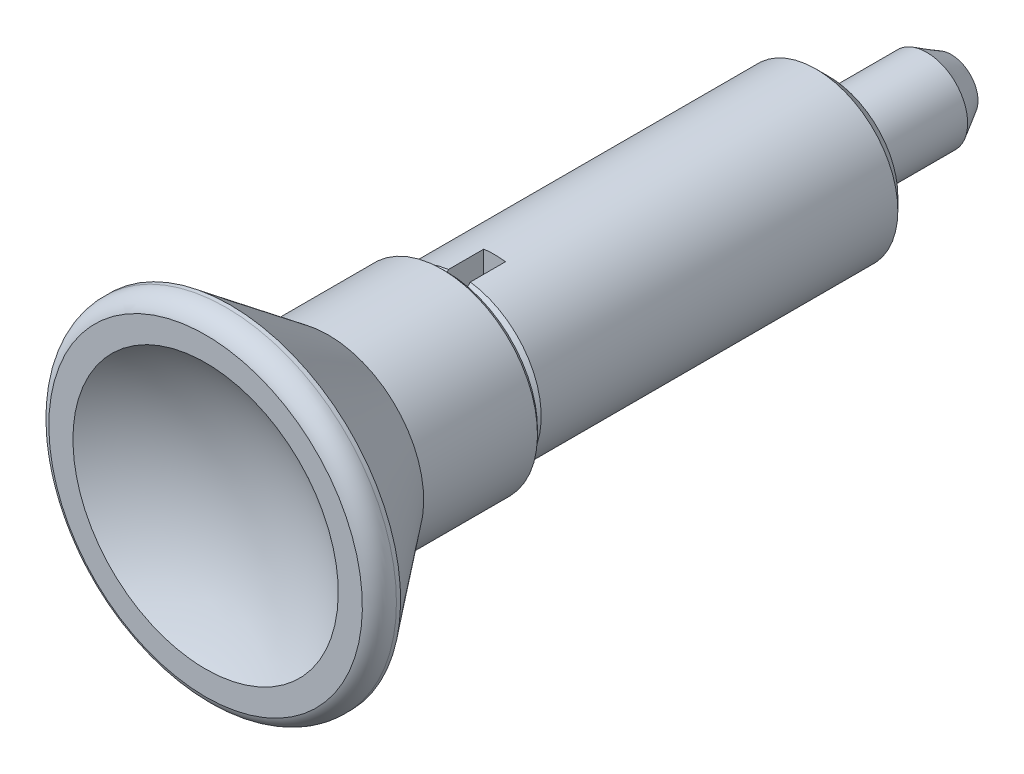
ISO-10303-21;
HEADER;
FILE_DESCRIPTION(('STEP AP214'),'2;1');
FILE_NAME('part.step','',(''),(''),'','','');
FILE_SCHEMA(('AUTOMOTIVE_DESIGN { 1 0 10303 214 1 1 1 1 }'));
ENDSEC;
DATA;
#1=APPLICATION_CONTEXT('core data for automotive mechanical design processes');
#2=APPLICATION_PROTOCOL_DEFINITION('international standard','automotive_design',2000,#1);
#3=PRODUCT_CONTEXT('',#1,'mechanical');
#4=PRODUCT('Part','Part','',(#3));
#5=PRODUCT_RELATED_PRODUCT_CATEGORY('part','',(#4));
#6=PRODUCT_DEFINITION_FORMATION('','',#4);
#7=PRODUCT_DEFINITION_CONTEXT('part definition',#1,'design');
#8=PRODUCT_DEFINITION('design','',#6,#7);
#9=PRODUCT_DEFINITION_SHAPE('','',#8);
#10=(LENGTH_UNIT() NAMED_UNIT(*) SI_UNIT(.MILLI.,.METRE.));
#11=(NAMED_UNIT(*) PLANE_ANGLE_UNIT() SI_UNIT($,.RADIAN.));
#12=(NAMED_UNIT(*) SI_UNIT($,.STERADIAN.) SOLID_ANGLE_UNIT());
#13=UNCERTAINTY_MEASURE_WITH_UNIT(LENGTH_MEASURE(1.E-05),#10,'distance_accuracy_value','');
#14=(GEOMETRIC_REPRESENTATION_CONTEXT(3) GLOBAL_UNCERTAINTY_ASSIGNED_CONTEXT((#13)) GLOBAL_UNIT_ASSIGNED_CONTEXT((#10,
#11,#12)) REPRESENTATION_CONTEXT('',''));
#15=CARTESIAN_POINT('',(0.,0.,0.));
#16=DIRECTION('',(0.,0.,1.));
#17=DIRECTION('',(1.,0.,0.));
#18=AXIS2_PLACEMENT_3D('',#15,#16,#17);
#19=CARTESIAN_POINT('',(0.8,14.,24.5));
#20=DIRECTION('',(0.,0.,1.));
#21=DIRECTION('',(0.,1.,0.));
#22=AXIS2_PLACEMENT_3D('',#19,#20,#21);
#23=PLANE('',#22);
#24=DIRECTION('',(0.,-1.,0.));
#25=VECTOR('',#24,1.);
#26=CARTESIAN_POINT('',(0.8,14.,24.5));
#27=LINE('',#26,#25);
#28=CARTESIAN_POINT('',(0.8,5.9464274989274,24.5));
#29=VERTEX_POINT('',#28);
#30=CARTESIAN_POINT('',(0.8,2.89136645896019,24.5));
#31=VERTEX_POINT('',#30);
#32=EDGE_CURVE('E88',#29,#31,#27,.T.);
#33=ORIENTED_EDGE('',*,*,#32,.F.);
#34=CARTESIAN_POINT('',(0.,0.,24.5));
#35=DIRECTION('',(0.,0.,1.));
#36=DIRECTION('',(0.,1.,0.));
#37=AXIS2_PLACEMENT_3D('',#34,#35,#36);
#38=CIRCLE('',#37,6.);
#39=CARTESIAN_POINT('',(-0.8,5.9464274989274,24.5));
#40=VERTEX_POINT('',#39);
#41=EDGE_CURVE('E248',#40,#29,#38,.F.);
#42=ORIENTED_EDGE('',*,*,#41,.F.);
#43=DIRECTION('',(0.,1.,0.));
#44=VECTOR('',#43,1.);
#45=CARTESIAN_POINT('',(-0.8,14.,24.5));
#46=LINE('',#45,#44);
#47=CARTESIAN_POINT('',(-0.8,2.89136645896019,24.5));
#48=VERTEX_POINT('',#47);
#49=EDGE_CURVE('E91',#48,#40,#46,.T.);
#50=ORIENTED_EDGE('',*,*,#49,.F.);
#51=CARTESIAN_POINT('',(0.,0.,24.5));
#52=DIRECTION('',(0.,0.,1.));
#53=DIRECTION('',(0.,1.,0.));
#54=AXIS2_PLACEMENT_3D('',#51,#52,#53);
#55=CIRCLE('',#54,3.);
#56=EDGE_CURVE('E85',#31,#48,#55,.T.);
#57=ORIENTED_EDGE('',*,*,#56,.F.);
#58=EDGE_LOOP('',(#33,#42,#50,#57));
#59=FACE_BOUND('',#58,.T.);
#60=ADVANCED_FACE('F14',(#59),#23,.T.);
#61=CARTESIAN_POINT('',(0.,0.,-9.));
#62=DIRECTION('',(0.,0.,1.));
#63=DIRECTION('',(0.,1.,0.));
#64=AXIS2_PLACEMENT_3D('',#61,#62,#63);
#65=CYLINDRICAL_SURFACE('',#64,3.);
#66=DIRECTION('',(0.,0.,1.));
#67=VECTOR('',#66,1.);
#68=CARTESIAN_POINT('',(-0.8,2.89136645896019,24.5));
#69=LINE('',#68,#67);
#70=CARTESIAN_POINT('',(-0.8,2.89136645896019,28.));
#71=VERTEX_POINT('',#70);
#72=EDGE_CURVE('E116',#71,#48,#69,.F.);
#73=ORIENTED_EDGE('',*,*,#72,.F.);
#74=CARTESIAN_POINT('',(0.,0.,28.));
#75=DIRECTION('',(0.,0.,1.));
#76=DIRECTION('',(0.,1.,0.));
#77=AXIS2_PLACEMENT_3D('',#74,#75,#76);
#78=CIRCLE('',#77,3.);
#79=CARTESIAN_POINT('',(0.8,2.89136645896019,28.));
#80=VERTEX_POINT('',#79);
#81=EDGE_CURVE('E95',#71,#80,#78,.F.);
#82=ORIENTED_EDGE('',*,*,#81,.T.);
#83=DIRECTION('',(0.,0.,1.));
#84=VECTOR('',#83,1.);
#85=CARTESIAN_POINT('',(0.8,2.89136645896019,28.));
#86=LINE('',#85,#84);
#87=EDGE_CURVE('E99',#31,#80,#86,.T.);
#88=ORIENTED_EDGE('',*,*,#87,.F.);
#89=ORIENTED_EDGE('',*,*,#56,.T.);
#90=EDGE_LOOP('',(#73,#82,#88,#89));
#91=FACE_BOUND('',#90,.T.);
#92=ADVANCED_FACE('F100',(#91),#65,.T.);
#93=CARTESIAN_POINT('',(0.8,14.,24.5));
#94=DIRECTION('',(0.,0.,1.));
#95=DIRECTION('',(0.,1.,0.));
#96=AXIS2_PLACEMENT_3D('',#93,#94,#95);
#97=PLANE('',#96);
#98=DIRECTION('',(0.,1.,0.));
#99=VECTOR('',#98,1.);
#100=CARTESIAN_POINT('',(-0.8,14.,24.5));
#101=LINE('',#100,#99);
#102=CARTESIAN_POINT('',(-0.8,-5.9464274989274,24.5));
#103=VERTEX_POINT('',#102);
#104=CARTESIAN_POINT('',(-0.8,-2.89136645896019,24.5));
#105=VERTEX_POINT('',#104);
#106=EDGE_CURVE('E212',#103,#105,#101,.T.);
#107=ORIENTED_EDGE('',*,*,#106,.F.);
#108=CARTESIAN_POINT('',(0.,0.,24.5));
#109=DIRECTION('',(0.,0.,1.));
#110=DIRECTION('',(0.,1.,0.));
#111=AXIS2_PLACEMENT_3D('',#108,#109,#110);
#112=CIRCLE('',#111,6.);
#113=CARTESIAN_POINT('',(0.8,-5.9464274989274,24.5));
#114=VERTEX_POINT('',#113);
#115=EDGE_CURVE('E218',#114,#103,#112,.F.);
#116=ORIENTED_EDGE('',*,*,#115,.F.);
#117=DIRECTION('',(0.,-1.,0.));
#118=VECTOR('',#117,1.);
#119=CARTESIAN_POINT('',(0.8,14.,24.5));
#120=LINE('',#119,#118);
#121=CARTESIAN_POINT('',(0.8,-2.89136645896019,24.5));
#122=VERTEX_POINT('',#121);
#123=EDGE_CURVE('E215',#122,#114,#120,.T.);
#124=ORIENTED_EDGE('',*,*,#123,.F.);
#125=CARTESIAN_POINT('',(0.,0.,24.5));
#126=DIRECTION('',(0.,0.,1.));
#127=DIRECTION('',(0.,1.,0.));
#128=AXIS2_PLACEMENT_3D('',#125,#126,#127);
#129=CIRCLE('',#128,3.);
#130=EDGE_CURVE('E243',#105,#122,#129,.T.);
#131=ORIENTED_EDGE('',*,*,#130,.F.);
#132=EDGE_LOOP('',(#107,#116,#124,#131));
#133=FACE_BOUND('',#132,.T.);
#134=ADVANCED_FACE('F242',(#133),#97,.T.);
#135=CARTESIAN_POINT('',(0.,0.,-9.));
#136=DIRECTION('',(0.,0.,1.));
#137=DIRECTION('',(0.,1.,0.));
#138=AXIS2_PLACEMENT_3D('',#135,#136,#137);
#139=CYLINDRICAL_SURFACE('',#138,3.);
#140=DIRECTION('',(0.,0.,1.));
#141=VECTOR('',#140,1.);
#142=CARTESIAN_POINT('',(-0.8,-2.89136645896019,24.5));
#143=LINE('',#142,#141);
#144=CARTESIAN_POINT('',(-0.8,-2.89136645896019,28.));
#145=VERTEX_POINT('',#144);
#146=EDGE_CURVE('E209',#105,#145,#143,.T.);
#147=ORIENTED_EDGE('',*,*,#146,.F.);
#148=ORIENTED_EDGE('',*,*,#130,.T.);
#149=DIRECTION('',(0.,0.,1.));
#150=VECTOR('',#149,1.);
#151=CARTESIAN_POINT('',(0.8,-2.89136645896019,28.));
#152=LINE('',#151,#150);
#153=CARTESIAN_POINT('',(0.8,-2.89136645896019,28.));
#154=VERTEX_POINT('',#153);
#155=EDGE_CURVE('E213',#154,#122,#152,.F.);
#156=ORIENTED_EDGE('',*,*,#155,.F.);
#157=CARTESIAN_POINT('',(0.,0.,28.));
#158=DIRECTION('',(0.,0.,1.));
#159=DIRECTION('',(0.,1.,0.));
#160=AXIS2_PLACEMENT_3D('',#157,#158,#159);
#161=CIRCLE('',#160,3.);
#162=EDGE_CURVE('E315',#154,#145,#161,.F.);
#163=ORIENTED_EDGE('',*,*,#162,.T.);
#164=EDGE_LOOP('',(#147,#148,#156,#163));
#165=FACE_BOUND('',#164,.T.);
#166=ADVANCED_FACE('F462',(#165),#139,.T.);
#167=CARTESIAN_POINT('',(0.,0.,0.));
#168=DIRECTION('',(0.,0.,1.));
#169=DIRECTION('',(0.,1.,0.));
#170=AXIS2_PLACEMENT_3D('',#167,#168,#169);
#171=CYLINDRICAL_SURFACE('',#170,6.);
#172=DIRECTION('',(0.,0.,1.));
#173=VECTOR('',#172,1.);
#174=CARTESIAN_POINT('',(0.8,-5.9464274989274,28.));
#175=LINE('',#174,#173);
#176=CARTESIAN_POINT('',(0.8,-5.94642749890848,27.0799999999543));
#177=VERTEX_POINT('',#176);
#178=EDGE_CURVE('E232',#114,#177,#175,.T.);
#179=ORIENTED_EDGE('',*,*,#178,.F.);
#180=ORIENTED_EDGE('',*,*,#115,.T.);
#181=DIRECTION('',(0.,0.,1.));
#182=VECTOR('',#181,1.);
#183=CARTESIAN_POINT('',(-0.8,-5.9464274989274,24.5));
#184=LINE('',#183,#182);
#185=CARTESIAN_POINT('',(-0.8,-5.94642749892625,27.0799999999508));
#186=VERTEX_POINT('',#185);
#187=EDGE_CURVE('E211',#186,#103,#184,.F.);
#188=ORIENTED_EDGE('',*,*,#187,.F.);
#189=CARTESIAN_POINT('',(0.,0.,27.0799999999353));
#190=DIRECTION('',(0.,0.,-1.));
#191=DIRECTION('',(0.,-1.,0.));
#192=AXIS2_PLACEMENT_3D('',#189,#190,#191);
#193=CIRCLE('',#192,5.99999999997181);
#194=CARTESIAN_POINT('',(-0.8,5.94642749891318,27.0799999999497));
#195=VERTEX_POINT('',#194);
#196=EDGE_CURVE('E206',#195,#186,#193,.F.);
#197=ORIENTED_EDGE('',*,*,#196,.F.);
#198=DIRECTION('',(0.,0.,1.));
#199=VECTOR('',#198,1.);
#200=CARTESIAN_POINT('',(-0.8,5.9464274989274,24.5));
#201=LINE('',#200,#199);
#202=EDGE_CURVE('E108',#40,#195,#201,.T.);
#203=ORIENTED_EDGE('',*,*,#202,.F.);
#204=ORIENTED_EDGE('',*,*,#41,.T.);
#205=DIRECTION('',(0.,0.,1.));
#206=VECTOR('',#205,1.);
#207=CARTESIAN_POINT('',(0.8,5.9464274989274,28.));
#208=LINE('',#207,#206);
#209=CARTESIAN_POINT('',(0.8,5.94642749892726,27.0799999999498));
#210=VERTEX_POINT('',#209);
#211=EDGE_CURVE('E103',#210,#29,#208,.F.);
#212=ORIENTED_EDGE('',*,*,#211,.F.);
#213=CARTESIAN_POINT('',(0.,0.,27.0799999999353));
#214=DIRECTION('',(0.,0.,-1.));
#215=DIRECTION('',(0.,-1.,0.));
#216=AXIS2_PLACEMENT_3D('',#213,#214,#215);
#217=CIRCLE('',#216,5.99999999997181);
#218=EDGE_CURVE('E229',#177,#210,#217,.F.);
#219=ORIENTED_EDGE('',*,*,#218,.F.);
#220=EDGE_LOOP('',(#179,#180,#188,#197,#203,#204,#212,#219));
#221=FACE_BOUND('',#220,.T.);
#222=CARTESIAN_POINT('',(0.,0.,0.92));
#223=DIRECTION('',(0.,0.,1.));
#224=DIRECTION('',(0.,1.,0.));
#225=AXIS2_PLACEMENT_3D('',#222,#223,#224);
#226=CIRCLE('',#225,6.);
#227=CARTESIAN_POINT('',(0.,6.,0.92));
#228=VERTEX_POINT('',#227);
#229=EDGE_CURVE('E96',#228,#228,#226,.T.);
#230=ORIENTED_EDGE('',*,*,#229,.T.);
#231=EDGE_LOOP('',(#230));
#232=FACE_BOUND('',#231,.T.);
#233=ADVANCED_FACE('F250',(#221,#232),#171,.T.);
#234=CARTESIAN_POINT('',(-0.8,14.,24.5));
#235=DIRECTION('',(1.,0.,0.));
#236=DIRECTION('',(0.,1.,0.));
#237=AXIS2_PLACEMENT_3D('',#234,#235,#236);
#238=PLANE('',#237);
#239=ORIENTED_EDGE('',*,*,#202,.T.);
#240=CARTESIAN_POINT('',(-0.8,5.01661240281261,27.9999999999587));
#241=CARTESIAN_POINT('',(-0.8,5.17171813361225,27.846804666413));
#242=CARTESIAN_POINT('',(-0.8,5.32675559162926,27.6935403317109));
#243=CARTESIAN_POINT('',(-0.8,5.63669395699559,27.3868736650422));
#244=CARTESIAN_POINT('',(-0.8,5.7915948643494,27.2334713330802));
#245=CARTESIAN_POINT('',(-0.8,5.94642749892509,27.0799999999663));
#246=B_SPLINE_CURVE_WITH_KNOTS('',3,(#240,#241,#242,#243,#244,#245),.UNSPECIFIED.,.F.,.F.,(4,2,
4),(0.,0.654017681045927,1.30803534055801),.UNSPECIFIED.);
#247=CARTESIAN_POINT('',(-0.8,5.01661240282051,27.999999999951));
#248=VERTEX_POINT('',#247);
#249=EDGE_CURVE('E222',#248,#195,#246,.T.);
#250=ORIENTED_EDGE('',*,*,#249,.F.);
#251=DIRECTION('',(0.,1.,0.));
#252=VECTOR('',#251,1.);
#253=CARTESIAN_POINT('',(-0.8,0.,28.));
#254=LINE('',#253,#252);
#255=EDGE_CURVE('E204',#248,#71,#254,.F.);
#256=ORIENTED_EDGE('',*,*,#255,.T.);
#257=ORIENTED_EDGE('',*,*,#72,.T.);
#258=ORIENTED_EDGE('',*,*,#49,.T.);
#259=EDGE_LOOP('',(#239,#250,#256,#257,#258));
#260=FACE_BOUND('',#259,.T.);
#261=ADVANCED_FACE('F285',(#260),#238,.T.);
#262=CARTESIAN_POINT('',(0.8,14.,28.));
#263=DIRECTION('',(-1.,0.,0.));
#264=DIRECTION('',(0.,-1.,0.));
#265=AXIS2_PLACEMENT_3D('',#262,#263,#264);
#266=PLANE('',#265);
#267=CARTESIAN_POINT('',(0.8,5.94642749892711,27.0799999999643));
#268=CARTESIAN_POINT('',(0.8,5.79159486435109,27.2334713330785));
#269=CARTESIAN_POINT('',(0.8,5.63669395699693,27.3868736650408));
#270=CARTESIAN_POINT('',(0.8,5.32675559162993,27.6935403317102));
#271=CARTESIAN_POINT('',(0.8,5.17171813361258,27.8468046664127));
#272=CARTESIAN_POINT('',(0.8,5.01661240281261,27.9999999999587));
#273=B_SPLINE_CURVE_WITH_KNOTS('',3,(#267,#268,#269,#270,#271,#272),.UNSPECIFIED.,.F.,.F.,(4,2,
4),(0.,0.654017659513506,1.30803534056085),.UNSPECIFIED.);
#274=CARTESIAN_POINT('',(0.8,5.01661240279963,27.9999999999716));
#275=VERTEX_POINT('',#274);
#276=EDGE_CURVE('E216',#210,#275,#273,.T.);
#277=ORIENTED_EDGE('',*,*,#276,.F.);
#278=ORIENTED_EDGE('',*,*,#211,.T.);
#279=ORIENTED_EDGE('',*,*,#32,.T.);
#280=ORIENTED_EDGE('',*,*,#87,.T.);
#281=DIRECTION('',(0.,1.,0.));
#282=VECTOR('',#281,1.);
#283=CARTESIAN_POINT('',(0.8,0.,28.));
#284=LINE('',#283,#282);
#285=EDGE_CURVE('E202',#80,#275,#284,.T.);
#286=ORIENTED_EDGE('',*,*,#285,.T.);
#287=EDGE_LOOP('',(#277,#278,#279,#280,#286));
#288=FACE_BOUND('',#287,.T.);
#289=ADVANCED_FACE('F107',(#288),#266,.T.);
#290=CARTESIAN_POINT('',(0.,0.,27.0799999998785));
#291=DIRECTION('',(0.,0.,-1.));
#292=DIRECTION('',(0.,-1.,0.));
#293=AXIS2_PLACEMENT_3D('',#290,#291,#292);
#294=CONICAL_SURFACE('',#293,6.00000000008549,0.785398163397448);
#295=ORIENTED_EDGE('',*,*,#276,.T.);
#296=CARTESIAN_POINT('',(0.,0.,27.9999999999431));
#297=DIRECTION('',(0.,0.,-1.));
#298=DIRECTION('',(0.,-1.,0.));
#299=AXIS2_PLACEMENT_3D('',#296,#297,#298);
#300=CIRCLE('',#299,5.08000000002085);
#301=CARTESIAN_POINT('',(0.8,-5.01661240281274,27.9999999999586));
#302=VERTEX_POINT('',#301);
#303=EDGE_CURVE('E201',#275,#302,#300,.T.);
#304=ORIENTED_EDGE('',*,*,#303,.T.);
#305=CARTESIAN_POINT('',(0.8,-5.946427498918,27.0799999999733));
#306=CARTESIAN_POINT('',(0.8,-5.79159486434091,27.2334713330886));
#307=CARTESIAN_POINT('',(0.8,-5.63669395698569,27.386873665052));
#308=CARTESIAN_POINT('',(0.8,-5.32675559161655,27.6935403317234));
#309=CARTESIAN_POINT('',(0.8,-5.17171813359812,27.846804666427));
#310=CARTESIAN_POINT('',(0.8,-5.01661240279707,27.9999999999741));
#311=B_SPLINE_CURVE_WITH_KNOTS('',3,(#305,#306,#307,#308,#309,#310),.UNSPECIFIED.,.F.,.F.,(4,2,
4),(0.,0.65401765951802,1.30803534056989),.UNSPECIFIED.);
#312=EDGE_CURVE('E228',#177,#302,#311,.T.);
#313=ORIENTED_EDGE('',*,*,#312,.F.);
#314=ORIENTED_EDGE('',*,*,#218,.T.);
#315=EDGE_LOOP('',(#295,#304,#313,#314));
#316=FACE_BOUND('',#315,.T.);
#317=ADVANCED_FACE('F255',(#316),#294,.T.);
#318=CARTESIAN_POINT('',(0.8,14.,28.));
#319=DIRECTION('',(-1.,0.,0.));
#320=DIRECTION('',(0.,-1.,0.));
#321=AXIS2_PLACEMENT_3D('',#318,#319,#320);
#322=PLANE('',#321);
#323=ORIENTED_EDGE('',*,*,#178,.T.);
#324=ORIENTED_EDGE('',*,*,#312,.T.);
#325=DIRECTION('',(0.,1.,0.));
#326=VECTOR('',#325,1.);
#327=CARTESIAN_POINT('',(0.8,0.,28.));
#328=LINE('',#327,#326);
#329=EDGE_CURVE('E198',#302,#154,#328,.T.);
#330=ORIENTED_EDGE('',*,*,#329,.T.);
#331=ORIENTED_EDGE('',*,*,#155,.T.);
#332=ORIENTED_EDGE('',*,*,#123,.T.);
#333=EDGE_LOOP('',(#323,#324,#330,#331,#332));
#334=FACE_BOUND('',#333,.T.);
#335=ADVANCED_FACE('F237',(#334),#322,.T.);
#336=CARTESIAN_POINT('',(-0.8,14.,24.5));
#337=DIRECTION('',(1.,0.,0.));
#338=DIRECTION('',(0.,1.,0.));
#339=AXIS2_PLACEMENT_3D('',#336,#337,#338);
#340=PLANE('',#339);
#341=CARTESIAN_POINT('',(-0.8,-5.94642749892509,27.0799999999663));
#342=CARTESIAN_POINT('',(-0.8,-5.7915948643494,27.2334713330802));
#343=CARTESIAN_POINT('',(-0.8,-5.63669395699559,27.3868736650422));
#344=CARTESIAN_POINT('',(-0.8,-5.32675559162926,27.6935403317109));
#345=CARTESIAN_POINT('',(-0.8,-5.17171813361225,27.846804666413));
#346=CARTESIAN_POINT('',(-0.8,-5.01661240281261,27.9999999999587));
#347=B_SPLINE_CURVE_WITH_KNOTS('',3,(#341,#342,#343,#344,#345,#346),.UNSPECIFIED.,.F.,.F.,(4,2,
4),(0.,0.654017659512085,1.30803534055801),.UNSPECIFIED.);
#348=CARTESIAN_POINT('',(-0.8,-5.01661240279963,27.9999999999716));
#349=VERTEX_POINT('',#348);
#350=EDGE_CURVE('E225',#186,#349,#347,.T.);
#351=ORIENTED_EDGE('',*,*,#350,.F.);
#352=ORIENTED_EDGE('',*,*,#187,.T.);
#353=ORIENTED_EDGE('',*,*,#106,.T.);
#354=ORIENTED_EDGE('',*,*,#146,.T.);
#355=DIRECTION('',(0.,1.,0.));
#356=VECTOR('',#355,1.);
#357=CARTESIAN_POINT('',(-0.8,0.,28.));
#358=LINE('',#357,#356);
#359=EDGE_CURVE('E33',#145,#349,#358,.F.);
#360=ORIENTED_EDGE('',*,*,#359,.T.);
#361=EDGE_LOOP('',(#351,#352,#353,#354,#360));
#362=FACE_BOUND('',#361,.T.);
#363=ADVANCED_FACE('F298',(#362),#340,.T.);
#364=CARTESIAN_POINT('',(0.,0.,27.0799999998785));
#365=DIRECTION('',(0.,0.,-1.));
#366=DIRECTION('',(0.,-1.,0.));
#367=AXIS2_PLACEMENT_3D('',#364,#365,#366);
#368=CONICAL_SURFACE('',#367,6.00000000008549,0.785398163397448);
#369=ORIENTED_EDGE('',*,*,#249,.T.);
#370=ORIENTED_EDGE('',*,*,#196,.T.);
#371=ORIENTED_EDGE('',*,*,#350,.T.);
#372=CARTESIAN_POINT('',(0.,0.,27.9999999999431));
#373=DIRECTION('',(0.,0.,-1.));
#374=DIRECTION('',(0.,-1.,0.));
#375=AXIS2_PLACEMENT_3D('',#372,#373,#374);
#376=CIRCLE('',#375,5.08000000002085);
#377=EDGE_CURVE('E143',#349,#248,#376,.T.);
#378=ORIENTED_EDGE('',*,*,#377,.T.);
#379=EDGE_LOOP('',(#369,#370,#371,#378));
#380=FACE_BOUND('',#379,.T.);
#381=ADVANCED_FACE('F165',(#380),#368,.T.);
#382=CARTESIAN_POINT('',(0.,0.,58.4));
#383=DIRECTION('',(1.,0.,0.));
#384=DIRECTION('',(0.,-1.,0.));
#385=AXIS2_PLACEMENT_3D('',#382,#383,#384);
#386=SPHERICAL_SURFACE('',#385,16.);
#387=CARTESIAN_POINT('',(0.,-9.73190628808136,45.7));
#388=CARTESIAN_POINT('',(0.273421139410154,-9.73190824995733,45.7));
#389=CARTESIAN_POINT('',(0.546810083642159,-9.72037876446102,45.7));
#390=CARTESIAN_POINT('',(1.09173602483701,-9.67434130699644,45.7));
#391=CARTESIAN_POINT('',(1.36327251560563,-9.6398272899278,45.7));
#392=CARTESIAN_POINT('',(1.90275798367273,-9.54800856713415,45.7));
#393=CARTESIAN_POINT('',(2.17070282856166,-9.49067960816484,45.7));
#394=CARTESIAN_POINT('',(2.70081243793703,-9.35363887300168,45.7));
#395=CARTESIAN_POINT('',(2.96297710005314,-9.27392670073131,45.7));
#396=CARTESIAN_POINT('',(3.47952585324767,-9.0927321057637,45.7));
#397=CARTESIAN_POINT('',(3.7339137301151,-8.9912604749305,45.7));
#398=CARTESIAN_POINT('',(4.23323988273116,-8.76724349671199,45.7));
#399=CARTESIAN_POINT('',(4.47817800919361,-8.64469781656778,45.7));
#400=CARTESIAN_POINT('',(4.95679945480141,-8.37943799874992,45.7));
#401=CARTESIAN_POINT('',(5.1904855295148,-8.23672883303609,45.7));
#402=CARTESIAN_POINT('',(5.64500156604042,-7.93213690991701,45.7));
#403=CARTESIAN_POINT('',(5.86583180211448,-7.77025456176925,45.7));
#404=CARTESIAN_POINT('',(6.29309658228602,-7.42844474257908,45.7));
#405=CARTESIAN_POINT('',(6.49952946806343,-7.2485151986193,45.7));
#406=CARTESIAN_POINT('',(6.89650428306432,-6.87190546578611,45.7));
#407=CARTESIAN_POINT('',(7.08704619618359,-6.67522525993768,45.7));
#408=CARTESIAN_POINT('',(7.45089134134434,-6.26650461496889,45.7));
#409=CARTESIAN_POINT('',(7.62419390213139,-6.05446357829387,45.7));
#410=CARTESIAN_POINT('',(7.95231974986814,-5.6165356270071,45.7));
#411=CARTESIAN_POINT('',(8.10714304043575,-5.39064871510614,45.7));
#412=CARTESIAN_POINT('',(8.39720695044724,-4.92663927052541,45.7));
#413=CARTESIAN_POINT('',(8.53244793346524,-4.68851696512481,45.7));
#414=CARTESIAN_POINT('',(8.78238916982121,-4.20172578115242,45.7));
#415=CARTESIAN_POINT('',(8.89708942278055,-3.95305690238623,45.7));
#416=CARTESIAN_POINT('',(9.10513353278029,-3.4469409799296,45.7));
#417=CARTESIAN_POINT('',(9.19847743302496,-3.18949395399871,45.7));
#418=CARTESIAN_POINT('',(9.36314551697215,-2.66765155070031,45.7));
#419=CARTESIAN_POINT('',(9.43446970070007,-2.40325617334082,45.7));
#420=CARTESIAN_POINT('',(9.55459139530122,-1.86939624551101,45.7));
#421=CARTESIAN_POINT('',(9.6033888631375,-1.59993168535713,45.7));
#422=CARTESIAN_POINT('',(9.6781100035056,-1.05784961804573,45.7));
#423=CARTESIAN_POINT('',(9.70403367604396,-0.785232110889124,45.7));
#424=CARTESIAN_POINT('',(9.73282289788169,-0.238782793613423,45.7));
#425=CARTESIAN_POINT('',(9.73568848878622,0.0350490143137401,45.7));
#426=CARTESIAN_POINT('',(9.71834128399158,0.581980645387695,45.7));
#427=CARTESIAN_POINT('',(9.69812848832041,0.855080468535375,45.7));
#428=CARTESIAN_POINT('',(9.6347681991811,1.39860665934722,45.7));
#429=CARTESIAN_POINT('',(9.59162069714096,1.66903302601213,45.7));
#430=CARTESIAN_POINT('',(9.48269774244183,2.20528963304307,45.7));
#431=CARTESIAN_POINT('',(9.41692228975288,2.47111987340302,45.7));
#432=CARTESIAN_POINT('',(9.26321097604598,2.9962946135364,45.7));
#433=CARTESIAN_POINT('',(9.17527509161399,3.25563910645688,45.7));
#434=CARTESIAN_POINT('',(8.9778681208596,3.76599827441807,45.7));
#435=CARTESIAN_POINT('',(8.86839703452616,4.01701294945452,45.7));
#436=CARTESIAN_POINT('',(8.62869797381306,4.50892783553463,45.7));
#437=CARTESIAN_POINT('',(8.49847000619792,4.7498280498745,45.7));
#438=CARTESIAN_POINT('',(8.21818300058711,5.21980144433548,45.7));
#439=CARTESIAN_POINT('',(8.06812396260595,5.44887462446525,45.7));
#440=CARTESIAN_POINT('',(7.74924171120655,5.89356528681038,45.7));
#441=CARTESIAN_POINT('',(7.58041850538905,6.10918277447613,45.7));
#442=CARTESIAN_POINT('',(7.22520810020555,6.52542924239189,45.7));
#443=CARTESIAN_POINT('',(7.0388209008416,6.72605822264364,45.7));
#444=CARTESIAN_POINT('',(6.64980758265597,7.1109013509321,45.7));
#445=CARTESIAN_POINT('',(6.447181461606,7.29511549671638,45.7));
#446=CARTESIAN_POINT('',(6.02713087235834,7.64581927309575,45.7));
#447=CARTESIAN_POINT('',(5.80970640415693,7.8123089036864,45.7));
#448=CARTESIAN_POINT('',(5.36160484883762,8.12638002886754,45.7));
#449=CARTESIAN_POINT('',(5.13092775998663,8.27396152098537,45.7));
#450=CARTESIAN_POINT('',(4.65796096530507,8.54916712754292,45.7));
#451=CARTESIAN_POINT('',(4.41567125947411,8.67679124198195,45.7));
#452=CARTESIAN_POINT('',(3.92120177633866,8.91117475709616,45.7));
#453=CARTESIAN_POINT('',(3.66902199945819,9.01793415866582,45.7));
#454=CARTESIAN_POINT('',(3.15656521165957,9.20982925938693,45.7));
#455=CARTESIAN_POINT('',(2.89628820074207,9.29496495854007,45.7));
#456=CARTESIAN_POINT('',(2.36948737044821,9.44300738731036,45.7));
#457=CARTESIAN_POINT('',(2.10296355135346,9.50591411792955,45.7));
#458=CARTESIAN_POINT('',(1.5655639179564,9.6090513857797,45.7));
#459=CARTESIAN_POINT('',(1.2946881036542,9.64928192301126,45.7));
#460=CARTESIAN_POINT('',(0.750510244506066,9.70678078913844,45.7));
#461=CARTESIAN_POINT('',(0.477208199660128,9.72404911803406,45.7));
#462=CARTESIAN_POINT('',(-0.0698791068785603,9.73550079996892,45.7));
#463=CARTESIAN_POINT('',(-0.343664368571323,9.72968415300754,45.7));
#464=CARTESIAN_POINT('',(-0.889771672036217,9.69500723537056,45.7));
#465=CARTESIAN_POINT('',(-1.16209371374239,9.66614696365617,45.7));
#466=CARTESIAN_POINT('',(-1.70333851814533,9.58558797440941,45.7));
#467=CARTESIAN_POINT('',(-1.97226128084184,9.53388925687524,45.7));
#468=CARTESIAN_POINT('',(-2.50479565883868,9.40802092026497,45.7));
#469=CARTESIAN_POINT('',(-2.76840727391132,9.3338513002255,45.7));
#470=CARTESIAN_POINT('',(-3.28844522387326,9.16356846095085,45.7));
#471=CARTESIAN_POINT('',(-3.54487155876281,9.06745524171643,45.7));
#472=CARTESIAN_POINT('',(-4.04871587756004,8.85396852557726,45.7));
#473=CARTESIAN_POINT('',(-4.29613386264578,8.73659503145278,45.7));
#474=CARTESIAN_POINT('',(-4.78020252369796,8.48142221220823,45.7));
#475=CARTESIAN_POINT('',(-5.0168531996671,8.34362288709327,45.7));
#476=CARTESIAN_POINT('',(-5.47770476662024,8.04857809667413,45.7));
#477=CARTESIAN_POINT('',(-5.70190565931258,7.89133263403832,45.7));
#478=CARTESIAN_POINT('',(-6.13626376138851,7.55851347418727,45.7));
#479=CARTESIAN_POINT('',(-6.34642097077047,7.3829397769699,45.7));
#480=CARTESIAN_POINT('',(-6.75119769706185,7.0147122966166,45.7));
#481=CARTESIAN_POINT('',(-6.94581720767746,6.82205850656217,45.7));
#482=CARTESIAN_POINT('',(-7.31813481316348,6.42104055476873,45.7));
#483=CARTESIAN_POINT('',(-7.49583290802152,6.21267639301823,45.7));
#484=CARTESIAN_POINT('',(-7.83304440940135,5.78171897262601,45.7));
#485=CARTESIAN_POINT('',(-7.99255780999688,5.55912570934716,45.7));
#486=CARTESIAN_POINT('',(-8.29226580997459,5.10129265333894,45.7));
#487=CARTESIAN_POINT('',(-8.43246040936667,4.86605286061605,45.7));
#488=CARTESIAN_POINT('',(-8.69253396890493,4.3845994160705,45.7));
#489=CARTESIAN_POINT('',(-8.81241295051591,4.13838577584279,45.7));
#490=CARTESIAN_POINT('',(-9.03100318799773,3.63673483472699,45.7));
#491=CARTESIAN_POINT('',(-9.12971444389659,3.38129753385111,45.7));
#492=CARTESIAN_POINT('',(-9.30526742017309,2.86301537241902,45.7));
#493=CARTESIAN_POINT('',(-9.3821091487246,2.60017051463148,45.7));
#494=CARTESIAN_POINT('',(-9.51337682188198,2.06894181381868,45.7));
#495=CARTESIAN_POINT('',(-9.56780276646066,1.80055797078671,45.7));
#496=CARTESIAN_POINT('',(-9.65385201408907,1.26015885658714,45.7));
#497=CARTESIAN_POINT('',(-9.68547527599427,0.988143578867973,45.7));
#498=CARTESIAN_POINT('',(-9.72569417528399,0.442415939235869,45.7));
#499=CARTESIAN_POINT('',(-9.73428981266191,0.16870357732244,45.7));
#500=CARTESIAN_POINT('',(-9.72839235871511,-0.378471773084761,45.7));
#501=CARTESIAN_POINT('',(-9.71389931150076,-0.651934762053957,45.7));
#502=CARTESIAN_POINT('',(-9.6619276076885,-1.19666773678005,45.7));
#503=CARTESIAN_POINT('',(-9.62444895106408,-1.46793772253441,45.7));
#504=CARTESIAN_POINT('',(-9.52677237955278,-2.00635667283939,45.7));
#505=CARTESIAN_POINT('',(-9.46657441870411,-2.2735056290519,45.7));
#506=CARTESIAN_POINT('',(-9.32388721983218,-2.80178267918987,45.7));
#507=CARTESIAN_POINT('',(-9.24139798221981,-3.0629107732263,45.7));
#508=CARTESIAN_POINT('',(-9.05471294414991,-3.57729441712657,45.7));
#509=CARTESIAN_POINT('',(-8.95051674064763,-3.83054982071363,45.7));
#510=CARTESIAN_POINT('',(-8.7211594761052,-4.3273824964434,45.7));
#511=CARTESIAN_POINT('',(-8.59599841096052,-4.57095976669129,45.7));
#512=CARTESIAN_POINT('',(-8.32560656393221,-5.04669509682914,45.7));
#513=CARTESIAN_POINT('',(-8.18037656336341,-5.27885360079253,45.7));
#514=CARTESIAN_POINT('',(-7.87087575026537,-5.73011089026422,45.7));
#515=CARTESIAN_POINT('',(-7.70660495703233,-5.94920968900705,45.7));
#516=CARTESIAN_POINT('',(-7.36021019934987,-6.37276584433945,45.7));
#517=CARTESIAN_POINT('',(-7.17808828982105,-6.57722488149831,45.7));
#518=CARTESIAN_POINT('',(-6.79726585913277,-6.97008025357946,45.7));
#519=CARTESIAN_POINT('',(-6.59856498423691,-7.15847624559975,45.7));
#520=CARTESIAN_POINT('',(-6.18594941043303,-7.51790585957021,45.7));
#521=CARTESIAN_POINT('',(-5.9720309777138,-7.6889351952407,45.7));
#522=CARTESIAN_POINT('',(-5.5305485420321,-8.01235979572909,45.7));
#523=CARTESIAN_POINT('',(-5.30298475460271,-8.1647553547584,45.7));
#524=CARTESIAN_POINT('',(-4.83571056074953,-8.44990255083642,45.7));
#525=CARTESIAN_POINT('',(-4.59599419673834,-8.58264442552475,45.7));
#526=CARTESIAN_POINT('',(-4.10623086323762,-8.82744687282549,45.7));
#527=CARTESIAN_POINT('',(-3.85618407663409,-8.93950781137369,45.7));
#528=CARTESIAN_POINT('',(-3.34780095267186,-9.14204631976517,45.7));
#529=CARTESIAN_POINT('',(-3.08947372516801,-9.23254674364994,45.7));
#530=CARTESIAN_POINT('',(-2.56620241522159,-9.3914519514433,45.7));
#531=CARTESIAN_POINT('',(-2.30126009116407,-9.45986254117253,45.7));
#532=CARTESIAN_POINT('',(-1.69995282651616,-9.58836325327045,45.7));
#533=CARTESIAN_POINT('',(-1.36222155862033,-9.64214620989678,45.7));
#534=CARTESIAN_POINT('',(-0.682976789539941,-9.71391650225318,45.7));
#535=CARTESIAN_POINT('',(-0.341463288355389,-9.73190383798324,45.7));
#536=CARTESIAN_POINT('',(0.,-9.73190628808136,45.7));
#537=B_SPLINE_CURVE_WITH_KNOTS('',3,(#387,#388,#389,#390,#391,#392,#393,#394,#395,#396,#397,
#398,#399,#400,#401,#402,#403,#404,#405,#406,#407,#408,#409,#410,#411,#412,#413,#414,#415,#416,
#417,#418,#419,#420,#421,#422,#423,#424,#425,#426,#427,#428,#429,#430,#431,#432,#433,#434,#435,
#436,#437,#438,#439,#440,#441,#442,#443,#444,#445,#446,#447,#448,#449,#450,#451,#452,#453,#454,
#455,#456,#457,#458,#459,#460,#461,#462,#463,#464,#465,#466,#467,#468,#469,#470,#471,#472,#473,
#474,#475,#476,#477,#478,#479,#480,#481,#482,#483,#484,#485,#486,#487,#488,#489,#490,#491,#492,
#493,#494,#495,#496,#497,#498,#499,#500,#501,#502,#503,#504,#505,#506,#507,#508,#509,#510,#511,
#512,#513,#514,#515,#516,#517,#518,#519,#520,#521,#522,#523,#524,#525,#526,#527,#528,#529,#530,
#531,#532,#533,#534,#535,#536),.UNSPECIFIED.,.T.,.F.,(4,2,2,2,2,2,2,2,2,2,2,2,2,2,2,2,2,2,2,2,2,
2,2,2,2,2,2,2,2,2,2,2,2,2,2,2,2,2,2,2,2,2,2,2,2,2,2,2,2,2,2,2,2,2,2,2,2,2,2,2,2,2,2,2,2,2,2,2,2,
2,2,2,2,2,4),(0.,0.81996515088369,1.6401460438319,2.46120116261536,3.28227081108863,
4.10293417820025,4.92361050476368,5.74408481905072,6.56454162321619,7.38509277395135,
8.20564475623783,9.02622867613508,9.84681243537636,10.6673809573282,11.4879494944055,
12.3085163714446,13.1290832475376,13.949651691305,14.7702201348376,15.590787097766,
16.4113540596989,17.2319213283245,18.0524885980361,18.8730567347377,19.6936248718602,
20.5141927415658,21.3347606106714,22.1553281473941,22.9758956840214,23.796463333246,
24.6170309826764,25.4375987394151,26.2581664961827,27.0787342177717,27.8993019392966,
28.7198696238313,29.540437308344,30.3610049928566,31.1815726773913,32.0021403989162,
32.8227081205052,33.6432758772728,34.4638436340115,35.2844112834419,36.1049789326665,
36.9255464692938,37.7461140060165,38.5666818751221,39.3872497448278,40.2078178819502,
41.0283860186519,41.8489532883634,42.669520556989,43.4900875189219,44.3106544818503,
45.1312229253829,45.9517913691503,46.7723582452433,47.5929251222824,48.4134936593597,
49.2340621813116,50.0546459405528,50.8752298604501,51.6957818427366,52.5163329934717,
53.3367897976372,54.1572641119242,54.9779404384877,55.7986038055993,56.6196734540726,
57.440728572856,58.2609094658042,59.0808746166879,60.1048919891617,61.1289093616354),.UNSPECIFIED.);
#538=CARTESIAN_POINT('',(0.,-9.73190628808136,45.7));
#539=VERTEX_POINT('',#538);
#540=EDGE_CURVE('E135',#539,#539,#537,.T.);
#541=ORIENTED_EDGE('',*,*,#540,.T.);
#542=EDGE_LOOP('',(#541));
#543=FACE_BOUND('',#542,.T.);
#544=ADVANCED_FACE('F145',(#543),#386,.F.);
#545=CARTESIAN_POINT('',(-6.64644660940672,0.,28.));
#546=DIRECTION('',(0.,0.,1.));
#547=DIRECTION('',(0.,1.,0.));
#548=AXIS2_PLACEMENT_3D('',#545,#546,#547);
#549=PLANE('',#548);
#550=CARTESIAN_POINT('',(0.,0.,28.));
#551=DIRECTION('',(0.,0.,1.));
#552=DIRECTION('',(0.,1.,0.));
#553=AXIS2_PLACEMENT_3D('',#550,#551,#552);
#554=CIRCLE('',#553,6.64644660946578);
#555=CARTESIAN_POINT('',(0.,6.64644660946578,28.));
#556=VERTEX_POINT('',#555);
#557=EDGE_CURVE('E132',#556,#556,#554,.T.);
#558=ORIENTED_EDGE('',*,*,#557,.F.);
#559=EDGE_LOOP('',(#558));
#560=FACE_BOUND('',#559,.T.);
#561=ORIENTED_EDGE('',*,*,#359,.F.);
#562=ORIENTED_EDGE('',*,*,#162,.F.);
#563=ORIENTED_EDGE('',*,*,#329,.F.);
#564=ORIENTED_EDGE('',*,*,#303,.F.);
#565=ORIENTED_EDGE('',*,*,#285,.F.);
#566=ORIENTED_EDGE('',*,*,#81,.F.);
#567=ORIENTED_EDGE('',*,*,#255,.F.);
#568=ORIENTED_EDGE('',*,*,#377,.F.);
#569=EDGE_LOOP('',(#561,#562,#563,#564,#565,#566,#567,#568));
#570=FACE_BOUND('',#569,.T.);
#571=ADVANCED_FACE('F155',(#560,#570),#549,.F.);
#572=CARTESIAN_POINT('',(-9.73190628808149,0.,45.7));
#573=DIRECTION('',(0.,0.,-1.));
#574=DIRECTION('',(0.,-1.,0.));
#575=AXIS2_PLACEMENT_3D('',#572,#573,#574);
#576=PLANE('',#575);
#577=ORIENTED_EDGE('',*,*,#540,.F.);
#578=EDGE_LOOP('',(#577));
#579=FACE_BOUND('',#578,.T.);
#580=CARTESIAN_POINT('',(0.,0.,45.7));
#581=DIRECTION('',(0.,0.,-1.));
#582=DIRECTION('',(0.,-1.,0.));
#583=AXIS2_PLACEMENT_3D('',#580,#581,#582);
#584=CIRCLE('',#583,11.5);
#585=CARTESIAN_POINT('',(0.,-11.5,45.7));
#586=VERTEX_POINT('',#585);
#587=EDGE_CURVE('E128',#586,#586,#584,.T.);
#588=ORIENTED_EDGE('',*,*,#587,.F.);
#589=EDGE_LOOP('',(#588));
#590=FACE_BOUND('',#589,.T.);
#591=ADVANCED_FACE('F150',(#579,#590),#576,.F.);
#592=CARTESIAN_POINT('',(0.,0.,28.3535533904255));
#593=DIRECTION('',(0.,0.,1.));
#594=DIRECTION('',(0.,1.,0.));
#595=AXIS2_PLACEMENT_3D('',#592,#593,#594);
#596=CONICAL_SURFACE('',#595,6.99999999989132,0.785398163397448);
#597=CARTESIAN_POINT('',(0.,0.,28.3535533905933));
#598=DIRECTION('',(0.,0.,1.));
#599=DIRECTION('',(0.,1.,0.));
#600=AXIS2_PLACEMENT_3D('',#597,#598,#599);
#601=CIRCLE('',#600,7.);
#602=CARTESIAN_POINT('',(0.,7.,28.3535533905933));
#603=VERTEX_POINT('',#602);
#604=EDGE_CURVE('E131',#603,#603,#601,.T.);
#605=ORIENTED_EDGE('',*,*,#604,.F.);
#606=EDGE_LOOP('',(#605));
#607=FACE_BOUND('',#606,.T.);
#608=ORIENTED_EDGE('',*,*,#557,.T.);
#609=EDGE_LOOP('',(#608));
#610=FACE_BOUND('',#609,.T.);
#611=ADVANCED_FACE('F154',(#607,#610),#596,.T.);
#612=CARTESIAN_POINT('',(0.,0.,44.2849378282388));
#613=DIRECTION('',(0.,0.,-1.));
#614=DIRECTION('',(0.,-1.,0.));
#615=AXIS2_PLACEMENT_3D('',#612,#613,#614);
#616=TOROIDAL_SURFACE('',#615,11.0024067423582,1.5);
#617=CARTESIAN_POINT('',(0.,0.,44.2));
#618=DIRECTION('',(0.,0.,1.));
#619=DIRECTION('',(0.,1.,0.));
#620=AXIS2_PLACEMENT_3D('',#617,#618,#619);
#621=CIRCLE('',#620,12.5);
#622=CARTESIAN_POINT('',(0.,12.5,44.2));
#623=VERTEX_POINT('',#622);
#624=EDGE_CURVE('E502',#623,#623,#621,.F.);
#625=ORIENTED_EDGE('',*,*,#624,.F.);
#626=EDGE_LOOP('',(#625));
#627=FACE_BOUND('',#626,.T.);
#628=ORIENTED_EDGE('',*,*,#587,.T.);
#629=EDGE_LOOP('',(#628));
#630=FACE_BOUND('',#629,.T.);
#631=ADVANCED_FACE('F187',(#627,#630),#616,.T.);
#632=CARTESIAN_POINT('',(0.,0.,-9.));
#633=DIRECTION('',(0.,0.,1.));
#634=DIRECTION('',(0.,1.,0.));
#635=AXIS2_PLACEMENT_3D('',#632,#633,#634);
#636=CYLINDRICAL_SURFACE('',#635,7.);
#637=CARTESIAN_POINT('',(0.,0.,36.7));
#638=DIRECTION('',(0.,0.,1.));
#639=DIRECTION('',(0.,1.,0.));
#640=AXIS2_PLACEMENT_3D('',#637,#638,#639);
#641=CIRCLE('',#640,7.);
#642=CARTESIAN_POINT('',(0.,7.,36.7));
#643=VERTEX_POINT('',#642);
#644=EDGE_CURVE('E24',#643,#643,#641,.T.);
#645=ORIENTED_EDGE('',*,*,#644,.F.);
#646=EDGE_LOOP('',(#645));
#647=FACE_BOUND('',#646,.T.);
#648=ORIENTED_EDGE('',*,*,#604,.T.);
#649=EDGE_LOOP('',(#648));
#650=FACE_BOUND('',#649,.T.);
#651=ADVANCED_FACE('F181',(#647,#650),#636,.T.);
#652=CARTESIAN_POINT('',(0.,0.,-9.));
#653=DIRECTION('',(0.,0.,1.));
#654=DIRECTION('',(0.,1.,0.));
#655=AXIS2_PLACEMENT_3D('',#652,#653,#654);
#656=CYLINDRICAL_SURFACE('',#655,12.5);
#657=ORIENTED_EDGE('',*,*,#624,.T.);
#658=EDGE_LOOP('',(#657));
#659=FACE_BOUND('',#658,.T.);
#660=CARTESIAN_POINT('',(0.,0.,43.8937013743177));
#661=DIRECTION('',(0.,0.,1.));
#662=DIRECTION('',(0.,1.,0.));
#663=AXIS2_PLACEMENT_3D('',#660,#661,#662);
#664=CIRCLE('',#663,12.5);
#665=CARTESIAN_POINT('',(0.,12.5,43.8937013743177));
#666=VERTEX_POINT('',#665);
#667=EDGE_CURVE('E9',#666,#666,#664,.F.);
#668=ORIENTED_EDGE('',*,*,#667,.F.);
#669=EDGE_LOOP('',(#668));
#670=FACE_BOUND('',#669,.T.);
#671=ADVANCED_FACE('F171',(#659,#670),#656,.T.);
#672=CARTESIAN_POINT('',(0.,0.,43.8937013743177));
#673=DIRECTION('',(0.,0.,1.));
#674=DIRECTION('',(1.,0.,0.));
#675=AXIS2_PLACEMENT_3D('',#672,#673,#674);
#676=CONICAL_SURFACE('',#675,12.5,0.65275314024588);
#677=ORIENTED_EDGE('',*,*,#667,.T.);
#678=EDGE_LOOP('',(#677));
#679=FACE_BOUND('',#678,.T.);
#680=ORIENTED_EDGE('',*,*,#644,.T.);
#681=EDGE_LOOP('',(#680));
#682=FACE_BOUND('',#681,.T.);
#683=ADVANCED_FACE('F169',(#679,#682),#676,.T.);
#684=CARTESIAN_POINT('',(-1.96076951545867,0.,-9.));
#685=DIRECTION('',(0.,0.,1.));
#686=DIRECTION('',(0.,1.,0.));
#687=AXIS2_PLACEMENT_3D('',#684,#685,#686);
#688=PLANE('',#687);
#689=CARTESIAN_POINT('',(0.,0.,-9.00000000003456));
#690=DIRECTION('',(0.,0.,1.));
#691=DIRECTION('',(0.,1.,0.));
#692=AXIS2_PLACEMENT_3D('',#689,#690,#691);
#693=CIRCLE('',#692,1.96076951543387);
#694=CARTESIAN_POINT('',(0.,1.96076951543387,-9.00000000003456));
#695=VERTEX_POINT('',#694);
#696=EDGE_CURVE('E18',#695,#695,#693,.T.);
#697=ORIENTED_EDGE('',*,*,#696,.F.);
#698=EDGE_LOOP('',(#697));
#699=FACE_BOUND('',#698,.T.);
#700=ADVANCED_FACE('F16',(#699),#688,.F.);
#701=CARTESIAN_POINT('',(0.,0.,-7.20000000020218));
#702=DIRECTION('',(0.,0.,1.));
#703=DIRECTION('',(0.,1.,0.));
#704=AXIS2_PLACEMENT_3D('',#701,#702,#703);
#705=CONICAL_SURFACE('',#704,2.99999999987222,0.523598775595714);
#706=CARTESIAN_POINT('',(0.,0.,-7.2));
#707=DIRECTION('',(0.,0.,1.));
#708=DIRECTION('',(0.,1.,0.));
#709=AXIS2_PLACEMENT_3D('',#706,#707,#708);
#710=CIRCLE('',#709,3.);
#711=CARTESIAN_POINT('',(0.,3.,-7.2));
#712=VERTEX_POINT('',#711);
#713=EDGE_CURVE('E122',#712,#712,#710,.T.);
#714=ORIENTED_EDGE('',*,*,#713,.F.);
#715=EDGE_LOOP('',(#714));
#716=FACE_BOUND('',#715,.T.);
#717=ORIENTED_EDGE('',*,*,#696,.T.);
#718=EDGE_LOOP('',(#717));
#719=FACE_BOUND('',#718,.T.);
#720=ADVANCED_FACE('F179',(#716,#719),#705,.T.);
#721=CARTESIAN_POINT('',(0.,0.,-9.));
#722=DIRECTION('',(0.,0.,1.));
#723=DIRECTION('',(0.,1.,0.));
#724=AXIS2_PLACEMENT_3D('',#721,#722,#723);
#725=CYLINDRICAL_SURFACE('',#724,3.);
#726=CARTESIAN_POINT('',(0.,0.,0.));
#727=DIRECTION('',(0.,0.,1.));
#728=DIRECTION('',(0.,1.,0.));
#729=AXIS2_PLACEMENT_3D('',#726,#727,#728);
#730=CIRCLE('',#729,3.);
#731=CARTESIAN_POINT('',(0.,3.,0.));
#732=VERTEX_POINT('',#731);
#733=EDGE_CURVE('E125',#732,#732,#730,.F.);
#734=ORIENTED_EDGE('',*,*,#733,.T.);
#735=EDGE_LOOP('',(#734));
#736=FACE_BOUND('',#735,.T.);
#737=ORIENTED_EDGE('',*,*,#713,.T.);
#738=EDGE_LOOP('',(#737));
#739=FACE_BOUND('',#738,.T.);
#740=ADVANCED_FACE('F324',(#736,#739),#725,.T.);
#741=CARTESIAN_POINT('',(-5.08,0.,0.));
#742=DIRECTION('',(0.,0.,1.));
#743=DIRECTION('',(0.,1.,0.));
#744=AXIS2_PLACEMENT_3D('',#741,#742,#743);
#745=PLANE('',#744);
#746=CARTESIAN_POINT('',(0.,0.,-2.00083005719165E-11));
#747=DIRECTION('',(0.,0.,1.));
#748=DIRECTION('',(1.,0.,0.));
#749=AXIS2_PLACEMENT_3D('',#746,#747,#748);
#750=CIRCLE('',#749,5.079999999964);
#751=CARTESIAN_POINT('',(5.079999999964,0.,-2.00097693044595E-11));
#752=VERTEX_POINT('',#751);
#753=EDGE_CURVE('E119',#752,#752,#750,.T.);
#754=ORIENTED_EDGE('',*,*,#753,.F.);
#755=EDGE_LOOP('',(#754));
#756=FACE_BOUND('',#755,.T.);
#757=ORIENTED_EDGE('',*,*,#733,.F.);
#758=EDGE_LOOP('',(#757));
#759=FACE_BOUND('',#758,.T.);
#760=ADVANCED_FACE('F327',(#756,#759),#745,.F.);
#761=CARTESIAN_POINT('',(0.,0.,0.919999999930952));
#762=DIRECTION('',(0.,0.,1.));
#763=DIRECTION('',(1.,0.,0.));
#764=AXIS2_PLACEMENT_3D('',#761,#762,#763);
#765=CONICAL_SURFACE('',#764,5.99999999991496,0.785398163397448);
#766=ORIENTED_EDGE('',*,*,#229,.F.);
#767=EDGE_LOOP('',(#766));
#768=FACE_BOUND('',#767,.T.);
#769=ORIENTED_EDGE('',*,*,#753,.T.);
#770=EDGE_LOOP('',(#769));
#771=FACE_BOUND('',#770,.T.);
#772=ADVANCED_FACE('F329',(#768,#771),#765,.T.);
#773=CLOSED_SHELL('',(#60,#92,#134,#166,#233,#261,#289,#317,#335,#363,#381,#544,#571,#591,#611,
#631,#651,#671,#683,#700,#720,#740,#760,#772));
#774=MANIFOLD_SOLID_BREP('B1',#773);
#775=ADVANCED_BREP_SHAPE_REPRESENTATION('',(#18,#774),#14);
#776=SHAPE_DEFINITION_REPRESENTATION(#9,#775);
ENDSEC;
END-ISO-10303-21;
